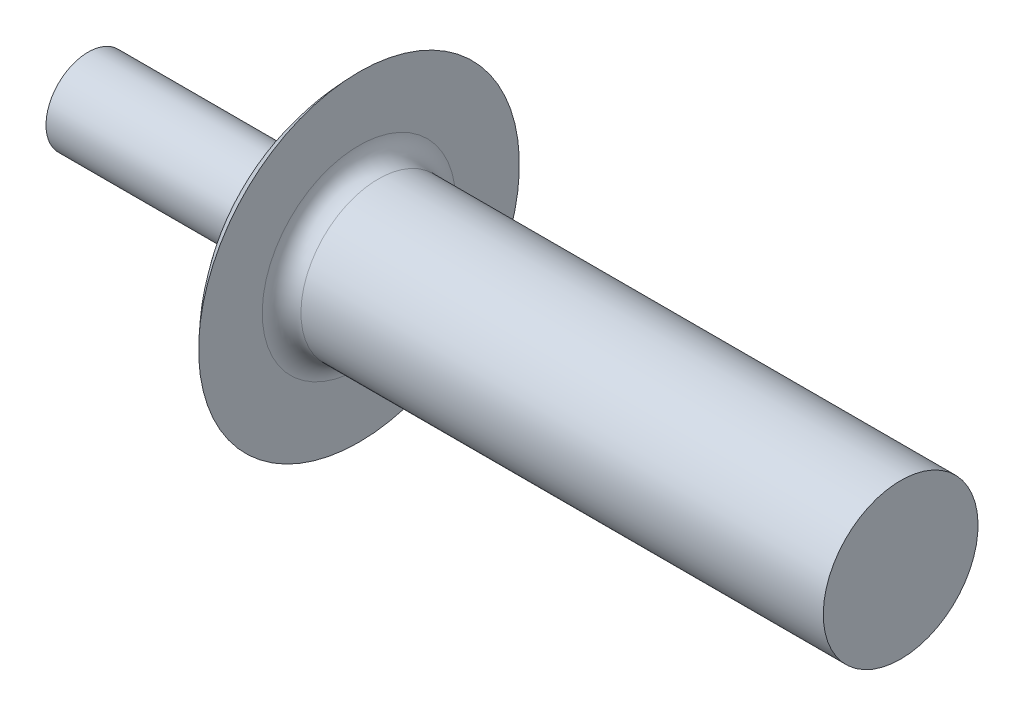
from build123d import *

# Parameters (mm, degrees)
FILLET1_R = 0.5


with BuildPart() as part:
    # Sketch1 → Base-Revolve (revolve)
    with BuildSketch(Plane(origin=(13.241356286, 10.121356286, 0), x_dir=(0, 1, 0), z_dir=(0, 0, 1)), mode=Mode.PRIVATE) as base_revolve_sk:
        with BuildLine():
            Line((-10.121356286, -7.758643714), (-8.121356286, -7.758643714))
            Line((-8.121356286, -7.758643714), (-8.121356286, 6.241356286))
            Line((-8.121356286, 6.241356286), (-5.976356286, 6.241356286))
            ThreePointArc((-5.976356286, 6.241356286), (-7.384550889, 7.268617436), (-9.031356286, 7.839852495))
            Line((-9.031356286, 7.839852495), (-9.031356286, 13.241356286))
            Line((-9.031356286, 13.241356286), (-10.121356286, 13.241356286))
            Line((-10.121356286, 13.241356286), (-10.121356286, -7.758643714))
        make_face()
    revolve(base_revolve_sk.sketch.rotate(Axis((-21.096328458, 0, 0), (1, 0, 0)), 180), axis=Axis((-21.096328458, 0, 0), (1, 0, 0)))

    # Fillet1
    fillet1_edges = [part.edges().sort_by_distance(p)[0] for p in [
        (7, 2, 0),
    ]]
    fillet(fillet1_edges, radius=FILLET1_R)


solid = part.part
